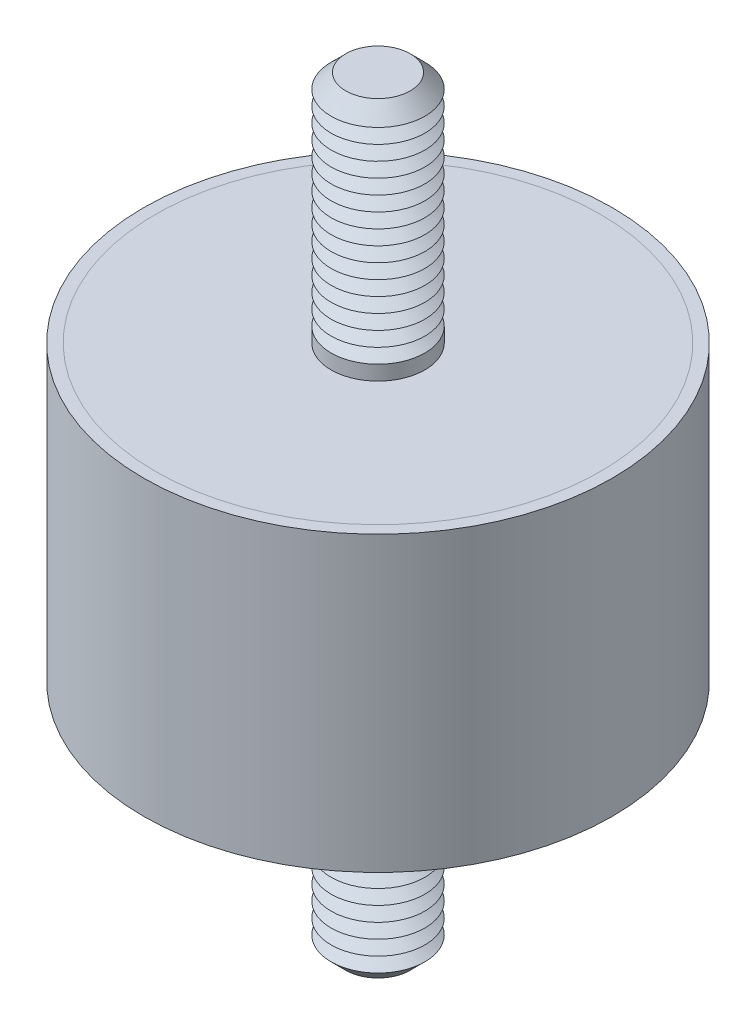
ISO-10303-21;
HEADER;
FILE_DESCRIPTION(('STEP AP214'),'2;1');
FILE_NAME('part.step','',(''),(''),'','','');
FILE_SCHEMA(('AUTOMOTIVE_DESIGN { 1 0 10303 214 1 1 1 1 }'));
ENDSEC;
DATA;
#1=APPLICATION_CONTEXT('core data for automotive mechanical design processes');
#2=APPLICATION_PROTOCOL_DEFINITION('international standard','automotive_design',2000,#1);
#3=PRODUCT_CONTEXT('',#1,'mechanical');
#4=PRODUCT('Part','Part','',(#3));
#5=PRODUCT_RELATED_PRODUCT_CATEGORY('part','',(#4));
#6=PRODUCT_DEFINITION_FORMATION('','',#4);
#7=PRODUCT_DEFINITION_CONTEXT('part definition',#1,'design');
#8=PRODUCT_DEFINITION('design','',#6,#7);
#9=PRODUCT_DEFINITION_SHAPE('','',#8);
#10=(LENGTH_UNIT() NAMED_UNIT(*) SI_UNIT(.MILLI.,.METRE.));
#11=(NAMED_UNIT(*) PLANE_ANGLE_UNIT() SI_UNIT($,.RADIAN.));
#12=(NAMED_UNIT(*) SI_UNIT($,.STERADIAN.) SOLID_ANGLE_UNIT());
#13=UNCERTAINTY_MEASURE_WITH_UNIT(LENGTH_MEASURE(1.E-05),#10,'distance_accuracy_value','');
#14=(GEOMETRIC_REPRESENTATION_CONTEXT(3) GLOBAL_UNCERTAINTY_ASSIGNED_CONTEXT((#13)) GLOBAL_UNIT_ASSIGNED_CONTEXT((#10,
#11,#12)) REPRESENTATION_CONTEXT('',''));
#15=CARTESIAN_POINT('',(0.,0.,0.));
#16=DIRECTION('',(0.,0.,1.));
#17=DIRECTION('',(1.,0.,0.));
#18=AXIS2_PLACEMENT_3D('',#15,#16,#17);
#19=CARTESIAN_POINT('',(0.,-32.5,0.));
#20=DIRECTION('',(0.,1.,0.));
#21=DIRECTION('',(0.,0.,1.));
#22=AXIS2_PLACEMENT_3D('',#19,#20,#21);
#23=CYLINDRICAL_SURFACE('',#22,4.);
#24=CARTESIAN_POINT('',(0.,-12.5,0.));
#25=DIRECTION('',(0.,-1.,0.));
#26=DIRECTION('',(0.,0.,-1.));
#27=AXIS2_PLACEMENT_3D('',#24,#25,#26);
#28=CIRCLE('',#27,4.);
#29=CARTESIAN_POINT('',(0.,-12.5,-4.));
#30=VERTEX_POINT('',#29);
#31=EDGE_CURVE('P0_E21',#30,#30,#28,.T.);
#32=ORIENTED_EDGE('',*,*,#31,.T.);
#33=EDGE_LOOP('',(#32));
#34=FACE_BOUND('',#33,.T.);
#35=CARTESIAN_POINT('',(0.,-13.75,0.));
#36=DIRECTION('',(0.,1.,0.));
#37=DIRECTION('',(0.,0.,1.));
#38=AXIS2_PLACEMENT_3D('',#35,#36,#37);
#39=CIRCLE('',#38,4.);
#40=CARTESIAN_POINT('',(0.,-13.75,4.));
#41=VERTEX_POINT('',#40);
#42=EDGE_CURVE('P0_E33',#41,#41,#39,.T.);
#43=ORIENTED_EDGE('',*,*,#42,.T.);
#44=EDGE_LOOP('',(#43));
#45=FACE_BOUND('',#44,.T.);
#46=ADVANCED_FACE('P0_F14',(#34,#45),#23,.T.);
#47=CARTESIAN_POINT('',(0.,-12.5,0.));
#48=DIRECTION('',(0.,1.,0.));
#49=DIRECTION('',(0.,0.,1.));
#50=AXIS2_PLACEMENT_3D('',#47,#48,#49);
#51=CYLINDRICAL_SURFACE('',#50,19.);
#52=CARTESIAN_POINT('',(0.,-12.5,0.));
#53=DIRECTION('',(0.,1.,0.));
#54=DIRECTION('',(0.,0.,1.));
#55=AXIS2_PLACEMENT_3D('',#52,#53,#54);
#56=CIRCLE('',#55,19.);
#57=CARTESIAN_POINT('',(0.,-12.5,19.));
#58=VERTEX_POINT('',#57);
#59=EDGE_CURVE('P0_E25',#58,#58,#56,.T.);
#60=ORIENTED_EDGE('',*,*,#59,.T.);
#61=EDGE_LOOP('',(#60));
#62=FACE_BOUND('',#61,.T.);
#63=CARTESIAN_POINT('',(0.,-11.5,0.));
#64=DIRECTION('',(0.,1.,0.));
#65=DIRECTION('',(0.,0.,1.));
#66=AXIS2_PLACEMENT_3D('',#63,#64,#65);
#67=CIRCLE('',#66,19.);
#68=CARTESIAN_POINT('',(0.,-11.5,19.));
#69=VERTEX_POINT('',#68);
#70=EDGE_CURVE('P0_E30',#69,#69,#67,.T.);
#71=ORIENTED_EDGE('',*,*,#70,.F.);
#72=EDGE_LOOP('',(#71));
#73=FACE_BOUND('',#72,.T.);
#74=ADVANCED_FACE('P0_F145',(#62,#73),#51,.T.);
#75=CARTESIAN_POINT('',(0.,-12.5,0.));
#76=DIRECTION('',(0.,1.,0.));
#77=DIRECTION('',(0.,0.,1.));
#78=AXIS2_PLACEMENT_3D('',#75,#76,#77);
#79=PLANE('',#78);
#80=ORIENTED_EDGE('',*,*,#31,.F.);
#81=EDGE_LOOP('',(#80));
#82=FACE_BOUND('',#81,.T.);
#83=ORIENTED_EDGE('',*,*,#59,.F.);
#84=EDGE_LOOP('',(#83));
#85=FACE_BOUND('',#84,.T.);
#86=ADVANCED_FACE('P0_F150',(#82,#85),#79,.F.);
#87=CARTESIAN_POINT('',(0.,-11.5,0.));
#88=DIRECTION('',(0.,1.,0.));
#89=DIRECTION('',(0.,0.,1.));
#90=AXIS2_PLACEMENT_3D('',#87,#88,#89);
#91=PLANE('',#90);
#92=ORIENTED_EDGE('',*,*,#70,.T.);
#93=EDGE_LOOP('',(#92));
#94=FACE_BOUND('',#93,.T.);
#95=ADVANCED_FACE('P0_F156',(#94),#91,.T.);
#96=CARTESIAN_POINT('',(0.,-13.75,0.));
#97=DIRECTION('',(0.,1.,0.));
#98=DIRECTION('',(0.,0.,1.));
#99=AXIS2_PLACEMENT_3D('',#96,#97,#98);
#100=CONICAL_SURFACE('',#99,4.,1.0471975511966);
#101=CARTESIAN_POINT('',(0.,-14.375,0.));
#102=DIRECTION('',(0.,1.,0.));
#103=DIRECTION('',(0.,0.,1.));
#104=AXIS2_PLACEMENT_3D('',#101,#102,#103);
#105=CIRCLE('',#104,2.91746824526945);
#106=CARTESIAN_POINT('',(0.,-14.375,2.91746824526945));
#107=VERTEX_POINT('',#106);
#108=EDGE_CURVE('P0_E39',#107,#107,#105,.T.);
#109=ORIENTED_EDGE('',*,*,#108,.T.);
#110=EDGE_LOOP('',(#109));
#111=FACE_BOUND('',#110,.T.);
#112=ORIENTED_EDGE('',*,*,#42,.F.);
#113=EDGE_LOOP('',(#112));
#114=FACE_BOUND('',#113,.T.);
#115=ADVANCED_FACE('P0_F159',(#111,#114),#100,.T.);
#116=CARTESIAN_POINT('',(0.,-14.375,0.));
#117=DIRECTION('',(0.,-1.,0.));
#118=DIRECTION('',(0.,0.,-1.));
#119=AXIS2_PLACEMENT_3D('',#116,#117,#118);
#120=CONICAL_SURFACE('',#119,2.91746824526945,1.0471975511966);
#121=CARTESIAN_POINT('',(0.,-15.,0.));
#122=DIRECTION('',(0.,1.,0.));
#123=DIRECTION('',(0.,0.,1.));
#124=AXIS2_PLACEMENT_3D('',#121,#122,#123);
#125=CIRCLE('',#124,4.);
#126=CARTESIAN_POINT('',(0.,-15.,4.));
#127=VERTEX_POINT('',#126);
#128=EDGE_CURVE('P0_E43',#127,#127,#125,.T.);
#129=ORIENTED_EDGE('',*,*,#128,.T.);
#130=EDGE_LOOP('',(#129));
#131=FACE_BOUND('',#130,.T.);
#132=ORIENTED_EDGE('',*,*,#108,.F.);
#133=EDGE_LOOP('',(#132));
#134=FACE_BOUND('',#133,.T.);
#135=ADVANCED_FACE('P0_F163',(#131,#134),#120,.T.);
#136=CARTESIAN_POINT('',(0.,-15.,0.));
#137=DIRECTION('',(0.,1.,0.));
#138=DIRECTION('',(0.,0.,1.));
#139=AXIS2_PLACEMENT_3D('',#136,#137,#138);
#140=CONICAL_SURFACE('',#139,4.,1.0471975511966);
#141=CARTESIAN_POINT('',(0.,-15.625,0.));
#142=DIRECTION('',(0.,1.,0.));
#143=DIRECTION('',(0.,0.,1.));
#144=AXIS2_PLACEMENT_3D('',#141,#142,#143);
#145=CIRCLE('',#144,2.91746824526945);
#146=CARTESIAN_POINT('',(0.,-15.625,2.91746824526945));
#147=VERTEX_POINT('',#146);
#148=EDGE_CURVE('P0_E47',#147,#147,#145,.T.);
#149=ORIENTED_EDGE('',*,*,#148,.T.);
#150=EDGE_LOOP('',(#149));
#151=FACE_BOUND('',#150,.T.);
#152=ORIENTED_EDGE('',*,*,#128,.F.);
#153=EDGE_LOOP('',(#152));
#154=FACE_BOUND('',#153,.T.);
#155=ADVANCED_FACE('P0_F167',(#151,#154),#140,.T.);
#156=CARTESIAN_POINT('',(0.,-15.625,0.));
#157=DIRECTION('',(0.,-1.,0.));
#158=DIRECTION('',(0.,0.,-1.));
#159=AXIS2_PLACEMENT_3D('',#156,#157,#158);
#160=CONICAL_SURFACE('',#159,2.91746824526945,1.0471975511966);
#161=CARTESIAN_POINT('',(0.,-16.25,0.));
#162=DIRECTION('',(0.,1.,0.));
#163=DIRECTION('',(0.,0.,1.));
#164=AXIS2_PLACEMENT_3D('',#161,#162,#163);
#165=CIRCLE('',#164,4.);
#166=CARTESIAN_POINT('',(0.,-16.25,4.));
#167=VERTEX_POINT('',#166);
#168=EDGE_CURVE('P0_E52',#167,#167,#165,.T.);
#169=ORIENTED_EDGE('',*,*,#168,.T.);
#170=EDGE_LOOP('',(#169));
#171=FACE_BOUND('',#170,.T.);
#172=ORIENTED_EDGE('',*,*,#148,.F.);
#173=EDGE_LOOP('',(#172));
#174=FACE_BOUND('',#173,.T.);
#175=ADVANCED_FACE('P0_F174',(#171,#174),#160,.T.);
#176=CARTESIAN_POINT('',(0.,-16.25,0.));
#177=DIRECTION('',(0.,1.,0.));
#178=DIRECTION('',(0.,0.,1.));
#179=AXIS2_PLACEMENT_3D('',#176,#177,#178);
#180=CONICAL_SURFACE('',#179,4.,1.0471975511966);
#181=CARTESIAN_POINT('',(0.,-16.875,0.));
#182=DIRECTION('',(0.,1.,0.));
#183=DIRECTION('',(0.,0.,1.));
#184=AXIS2_PLACEMENT_3D('',#181,#182,#183);
#185=CIRCLE('',#184,2.91746824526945);
#186=CARTESIAN_POINT('',(0.,-16.875,2.91746824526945));
#187=VERTEX_POINT('',#186);
#188=EDGE_CURVE('P0_E55',#187,#187,#185,.T.);
#189=ORIENTED_EDGE('',*,*,#188,.T.);
#190=EDGE_LOOP('',(#189));
#191=FACE_BOUND('',#190,.T.);
#192=ORIENTED_EDGE('',*,*,#168,.F.);
#193=EDGE_LOOP('',(#192));
#194=FACE_BOUND('',#193,.T.);
#195=ADVANCED_FACE('P0_F178',(#191,#194),#180,.T.);
#196=CARTESIAN_POINT('',(0.,-16.875,0.));
#197=DIRECTION('',(0.,-1.,0.));
#198=DIRECTION('',(0.,0.,-1.));
#199=AXIS2_PLACEMENT_3D('',#196,#197,#198);
#200=CONICAL_SURFACE('',#199,2.91746824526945,1.0471975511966);
#201=CARTESIAN_POINT('',(0.,-17.5,0.));
#202=DIRECTION('',(0.,1.,0.));
#203=DIRECTION('',(0.,0.,1.));
#204=AXIS2_PLACEMENT_3D('',#201,#202,#203);
#205=CIRCLE('',#204,4.);
#206=CARTESIAN_POINT('',(0.,-17.5,4.));
#207=VERTEX_POINT('',#206);
#208=EDGE_CURVE('P0_E58',#207,#207,#205,.T.);
#209=ORIENTED_EDGE('',*,*,#208,.T.);
#210=EDGE_LOOP('',(#209));
#211=FACE_BOUND('',#210,.T.);
#212=ORIENTED_EDGE('',*,*,#188,.F.);
#213=EDGE_LOOP('',(#212));
#214=FACE_BOUND('',#213,.T.);
#215=ADVANCED_FACE('P0_F182',(#211,#214),#200,.T.);
#216=CARTESIAN_POINT('',(0.,-17.5,0.));
#217=DIRECTION('',(0.,1.,0.));
#218=DIRECTION('',(0.,0.,1.));
#219=AXIS2_PLACEMENT_3D('',#216,#217,#218);
#220=CONICAL_SURFACE('',#219,4.,1.0471975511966);
#221=CARTESIAN_POINT('',(0.,-18.125,0.));
#222=DIRECTION('',(0.,1.,0.));
#223=DIRECTION('',(0.,0.,1.));
#224=AXIS2_PLACEMENT_3D('',#221,#222,#223);
#225=CIRCLE('',#224,2.91746824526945);
#226=CARTESIAN_POINT('',(0.,-18.125,2.91746824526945));
#227=VERTEX_POINT('',#226);
#228=EDGE_CURVE('P0_E61',#227,#227,#225,.T.);
#229=ORIENTED_EDGE('',*,*,#228,.T.);
#230=EDGE_LOOP('',(#229));
#231=FACE_BOUND('',#230,.T.);
#232=ORIENTED_EDGE('',*,*,#208,.F.);
#233=EDGE_LOOP('',(#232));
#234=FACE_BOUND('',#233,.T.);
#235=ADVANCED_FACE('P0_F186',(#231,#234),#220,.T.);
#236=CARTESIAN_POINT('',(0.,-18.125,0.));
#237=DIRECTION('',(0.,-1.,0.));
#238=DIRECTION('',(0.,0.,-1.));
#239=AXIS2_PLACEMENT_3D('',#236,#237,#238);
#240=CONICAL_SURFACE('',#239,2.91746824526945,1.0471975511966);
#241=CARTESIAN_POINT('',(0.,-18.75,0.));
#242=DIRECTION('',(0.,1.,0.));
#243=DIRECTION('',(0.,0.,1.));
#244=AXIS2_PLACEMENT_3D('',#241,#242,#243);
#245=CIRCLE('',#244,4.);
#246=CARTESIAN_POINT('',(0.,-18.75,4.));
#247=VERTEX_POINT('',#246);
#248=EDGE_CURVE('P0_E64',#247,#247,#245,.T.);
#249=ORIENTED_EDGE('',*,*,#248,.T.);
#250=EDGE_LOOP('',(#249));
#251=FACE_BOUND('',#250,.T.);
#252=ORIENTED_EDGE('',*,*,#228,.F.);
#253=EDGE_LOOP('',(#252));
#254=FACE_BOUND('',#253,.T.);
#255=ADVANCED_FACE('P0_F190',(#251,#254),#240,.T.);
#256=CARTESIAN_POINT('',(0.,-18.75,0.));
#257=DIRECTION('',(0.,1.,0.));
#258=DIRECTION('',(0.,0.,1.));
#259=AXIS2_PLACEMENT_3D('',#256,#257,#258);
#260=CONICAL_SURFACE('',#259,4.,1.0471975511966);
#261=CARTESIAN_POINT('',(0.,-19.375,0.));
#262=DIRECTION('',(0.,1.,0.));
#263=DIRECTION('',(0.,0.,1.));
#264=AXIS2_PLACEMENT_3D('',#261,#262,#263);
#265=CIRCLE('',#264,2.91746824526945);
#266=CARTESIAN_POINT('',(0.,-19.375,2.91746824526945));
#267=VERTEX_POINT('',#266);
#268=EDGE_CURVE('P0_E67',#267,#267,#265,.T.);
#269=ORIENTED_EDGE('',*,*,#268,.T.);
#270=EDGE_LOOP('',(#269));
#271=FACE_BOUND('',#270,.T.);
#272=ORIENTED_EDGE('',*,*,#248,.F.);
#273=EDGE_LOOP('',(#272));
#274=FACE_BOUND('',#273,.T.);
#275=ADVANCED_FACE('P0_F194',(#271,#274),#260,.T.);
#276=CARTESIAN_POINT('',(0.,-19.375,0.));
#277=DIRECTION('',(0.,-1.,0.));
#278=DIRECTION('',(0.,0.,-1.));
#279=AXIS2_PLACEMENT_3D('',#276,#277,#278);
#280=CONICAL_SURFACE('',#279,2.91746824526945,1.0471975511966);
#281=CARTESIAN_POINT('',(0.,-20.,0.));
#282=DIRECTION('',(0.,1.,0.));
#283=DIRECTION('',(0.,0.,1.));
#284=AXIS2_PLACEMENT_3D('',#281,#282,#283);
#285=CIRCLE('',#284,4.);
#286=CARTESIAN_POINT('',(0.,-20.,4.));
#287=VERTEX_POINT('',#286);
#288=EDGE_CURVE('P0_E70',#287,#287,#285,.T.);
#289=ORIENTED_EDGE('',*,*,#288,.T.);
#290=EDGE_LOOP('',(#289));
#291=FACE_BOUND('',#290,.T.);
#292=ORIENTED_EDGE('',*,*,#268,.F.);
#293=EDGE_LOOP('',(#292));
#294=FACE_BOUND('',#293,.T.);
#295=ADVANCED_FACE('P0_F198',(#291,#294),#280,.T.);
#296=CARTESIAN_POINT('',(0.,-20.,0.));
#297=DIRECTION('',(0.,1.,0.));
#298=DIRECTION('',(0.,0.,1.));
#299=AXIS2_PLACEMENT_3D('',#296,#297,#298);
#300=CONICAL_SURFACE('',#299,4.,1.0471975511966);
#301=CARTESIAN_POINT('',(0.,-20.625,0.));
#302=DIRECTION('',(0.,1.,0.));
#303=DIRECTION('',(0.,0.,1.));
#304=AXIS2_PLACEMENT_3D('',#301,#302,#303);
#305=CIRCLE('',#304,2.91746824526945);
#306=CARTESIAN_POINT('',(0.,-20.625,2.91746824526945));
#307=VERTEX_POINT('',#306);
#308=EDGE_CURVE('P0_E73',#307,#307,#305,.T.);
#309=ORIENTED_EDGE('',*,*,#308,.T.);
#310=EDGE_LOOP('',(#309));
#311=FACE_BOUND('',#310,.T.);
#312=ORIENTED_EDGE('',*,*,#288,.F.);
#313=EDGE_LOOP('',(#312));
#314=FACE_BOUND('',#313,.T.);
#315=ADVANCED_FACE('P0_F202',(#311,#314),#300,.T.);
#316=CARTESIAN_POINT('',(0.,-20.625,0.));
#317=DIRECTION('',(0.,-1.,0.));
#318=DIRECTION('',(0.,0.,-1.));
#319=AXIS2_PLACEMENT_3D('',#316,#317,#318);
#320=CONICAL_SURFACE('',#319,2.91746824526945,1.0471975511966);
#321=CARTESIAN_POINT('',(0.,-21.25,0.));
#322=DIRECTION('',(0.,1.,0.));
#323=DIRECTION('',(0.,0.,1.));
#324=AXIS2_PLACEMENT_3D('',#321,#322,#323);
#325=CIRCLE('',#324,4.);
#326=CARTESIAN_POINT('',(0.,-21.25,4.));
#327=VERTEX_POINT('',#326);
#328=EDGE_CURVE('P0_E76',#327,#327,#325,.T.);
#329=ORIENTED_EDGE('',*,*,#328,.T.);
#330=EDGE_LOOP('',(#329));
#331=FACE_BOUND('',#330,.T.);
#332=ORIENTED_EDGE('',*,*,#308,.F.);
#333=EDGE_LOOP('',(#332));
#334=FACE_BOUND('',#333,.T.);
#335=ADVANCED_FACE('P0_F206',(#331,#334),#320,.T.);
#336=CARTESIAN_POINT('',(0.,-21.25,0.));
#337=DIRECTION('',(0.,1.,0.));
#338=DIRECTION('',(0.,0.,1.));
#339=AXIS2_PLACEMENT_3D('',#336,#337,#338);
#340=CONICAL_SURFACE('',#339,4.,1.0471975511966);
#341=CARTESIAN_POINT('',(0.,-21.875,0.));
#342=DIRECTION('',(0.,1.,0.));
#343=DIRECTION('',(0.,0.,1.));
#344=AXIS2_PLACEMENT_3D('',#341,#342,#343);
#345=CIRCLE('',#344,2.91746824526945);
#346=CARTESIAN_POINT('',(0.,-21.875,2.91746824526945));
#347=VERTEX_POINT('',#346);
#348=EDGE_CURVE('P0_E79',#347,#347,#345,.T.);
#349=ORIENTED_EDGE('',*,*,#348,.T.);
#350=EDGE_LOOP('',(#349));
#351=FACE_BOUND('',#350,.T.);
#352=ORIENTED_EDGE('',*,*,#328,.F.);
#353=EDGE_LOOP('',(#352));
#354=FACE_BOUND('',#353,.T.);
#355=ADVANCED_FACE('P0_F210',(#351,#354),#340,.T.);
#356=CARTESIAN_POINT('',(0.,-21.875,0.));
#357=DIRECTION('',(0.,-1.,0.));
#358=DIRECTION('',(0.,0.,-1.));
#359=AXIS2_PLACEMENT_3D('',#356,#357,#358);
#360=CONICAL_SURFACE('',#359,2.91746824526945,1.0471975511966);
#361=CARTESIAN_POINT('',(0.,-22.5,0.));
#362=DIRECTION('',(0.,1.,0.));
#363=DIRECTION('',(0.,0.,1.));
#364=AXIS2_PLACEMENT_3D('',#361,#362,#363);
#365=CIRCLE('',#364,4.);
#366=CARTESIAN_POINT('',(0.,-22.5,4.));
#367=VERTEX_POINT('',#366);
#368=EDGE_CURVE('P0_E82',#367,#367,#365,.T.);
#369=ORIENTED_EDGE('',*,*,#368,.T.);
#370=EDGE_LOOP('',(#369));
#371=FACE_BOUND('',#370,.T.);
#372=ORIENTED_EDGE('',*,*,#348,.F.);
#373=EDGE_LOOP('',(#372));
#374=FACE_BOUND('',#373,.T.);
#375=ADVANCED_FACE('P0_F214',(#371,#374),#360,.T.);
#376=CARTESIAN_POINT('',(0.,-22.5,0.));
#377=DIRECTION('',(0.,1.,0.));
#378=DIRECTION('',(0.,0.,1.));
#379=AXIS2_PLACEMENT_3D('',#376,#377,#378);
#380=CONICAL_SURFACE('',#379,4.,1.0471975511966);
#381=CARTESIAN_POINT('',(0.,-23.125,0.));
#382=DIRECTION('',(0.,1.,0.));
#383=DIRECTION('',(0.,0.,1.));
#384=AXIS2_PLACEMENT_3D('',#381,#382,#383);
#385=CIRCLE('',#384,2.91746824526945);
#386=CARTESIAN_POINT('',(0.,-23.125,2.91746824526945));
#387=VERTEX_POINT('',#386);
#388=EDGE_CURVE('P0_E85',#387,#387,#385,.T.);
#389=ORIENTED_EDGE('',*,*,#388,.T.);
#390=EDGE_LOOP('',(#389));
#391=FACE_BOUND('',#390,.T.);
#392=ORIENTED_EDGE('',*,*,#368,.F.);
#393=EDGE_LOOP('',(#392));
#394=FACE_BOUND('',#393,.T.);
#395=ADVANCED_FACE('P0_F218',(#391,#394),#380,.T.);
#396=CARTESIAN_POINT('',(0.,-23.125,0.));
#397=DIRECTION('',(0.,-1.,0.));
#398=DIRECTION('',(0.,0.,-1.));
#399=AXIS2_PLACEMENT_3D('',#396,#397,#398);
#400=CONICAL_SURFACE('',#399,2.91746824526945,1.0471975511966);
#401=CARTESIAN_POINT('',(0.,-23.75,0.));
#402=DIRECTION('',(0.,1.,0.));
#403=DIRECTION('',(0.,0.,1.));
#404=AXIS2_PLACEMENT_3D('',#401,#402,#403);
#405=CIRCLE('',#404,4.);
#406=CARTESIAN_POINT('',(0.,-23.75,4.));
#407=VERTEX_POINT('',#406);
#408=EDGE_CURVE('P0_E88',#407,#407,#405,.T.);
#409=ORIENTED_EDGE('',*,*,#408,.T.);
#410=EDGE_LOOP('',(#409));
#411=FACE_BOUND('',#410,.T.);
#412=ORIENTED_EDGE('',*,*,#388,.F.);
#413=EDGE_LOOP('',(#412));
#414=FACE_BOUND('',#413,.T.);
#415=ADVANCED_FACE('P0_F222',(#411,#414),#400,.T.);
#416=CARTESIAN_POINT('',(0.,-23.75,0.));
#417=DIRECTION('',(0.,1.,0.));
#418=DIRECTION('',(0.,0.,1.));
#419=AXIS2_PLACEMENT_3D('',#416,#417,#418);
#420=CONICAL_SURFACE('',#419,4.,1.0471975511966);
#421=CARTESIAN_POINT('',(0.,-24.375,0.));
#422=DIRECTION('',(0.,1.,0.));
#423=DIRECTION('',(0.,0.,1.));
#424=AXIS2_PLACEMENT_3D('',#421,#422,#423);
#425=CIRCLE('',#424,2.91746824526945);
#426=CARTESIAN_POINT('',(0.,-24.375,2.91746824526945));
#427=VERTEX_POINT('',#426);
#428=EDGE_CURVE('P0_E91',#427,#427,#425,.T.);
#429=ORIENTED_EDGE('',*,*,#428,.T.);
#430=EDGE_LOOP('',(#429));
#431=FACE_BOUND('',#430,.T.);
#432=ORIENTED_EDGE('',*,*,#408,.F.);
#433=EDGE_LOOP('',(#432));
#434=FACE_BOUND('',#433,.T.);
#435=ADVANCED_FACE('P0_F226',(#431,#434),#420,.T.);
#436=CARTESIAN_POINT('',(0.,-24.375,0.));
#437=DIRECTION('',(0.,-1.,0.));
#438=DIRECTION('',(0.,0.,-1.));
#439=AXIS2_PLACEMENT_3D('',#436,#437,#438);
#440=CONICAL_SURFACE('',#439,2.91746824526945,1.0471975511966);
#441=CARTESIAN_POINT('',(0.,-25.,0.));
#442=DIRECTION('',(0.,1.,0.));
#443=DIRECTION('',(0.,0.,1.));
#444=AXIS2_PLACEMENT_3D('',#441,#442,#443);
#445=CIRCLE('',#444,4.);
#446=CARTESIAN_POINT('',(0.,-25.,4.));
#447=VERTEX_POINT('',#446);
#448=EDGE_CURVE('P0_E94',#447,#447,#445,.T.);
#449=ORIENTED_EDGE('',*,*,#448,.T.);
#450=EDGE_LOOP('',(#449));
#451=FACE_BOUND('',#450,.T.);
#452=ORIENTED_EDGE('',*,*,#428,.F.);
#453=EDGE_LOOP('',(#452));
#454=FACE_BOUND('',#453,.T.);
#455=ADVANCED_FACE('P0_F230',(#451,#454),#440,.T.);
#456=CARTESIAN_POINT('',(0.,-25.,0.));
#457=DIRECTION('',(0.,1.,0.));
#458=DIRECTION('',(0.,0.,1.));
#459=AXIS2_PLACEMENT_3D('',#456,#457,#458);
#460=CONICAL_SURFACE('',#459,4.,1.0471975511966);
#461=CARTESIAN_POINT('',(0.,-25.625,0.));
#462=DIRECTION('',(0.,1.,0.));
#463=DIRECTION('',(0.,0.,1.));
#464=AXIS2_PLACEMENT_3D('',#461,#462,#463);
#465=CIRCLE('',#464,2.91746824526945);
#466=CARTESIAN_POINT('',(0.,-25.625,2.91746824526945));
#467=VERTEX_POINT('',#466);
#468=EDGE_CURVE('P0_E97',#467,#467,#465,.T.);
#469=ORIENTED_EDGE('',*,*,#468,.T.);
#470=EDGE_LOOP('',(#469));
#471=FACE_BOUND('',#470,.T.);
#472=ORIENTED_EDGE('',*,*,#448,.F.);
#473=EDGE_LOOP('',(#472));
#474=FACE_BOUND('',#473,.T.);
#475=ADVANCED_FACE('P0_F234',(#471,#474),#460,.T.);
#476=CARTESIAN_POINT('',(0.,-25.625,0.));
#477=DIRECTION('',(0.,-1.,0.));
#478=DIRECTION('',(0.,0.,-1.));
#479=AXIS2_PLACEMENT_3D('',#476,#477,#478);
#480=CONICAL_SURFACE('',#479,2.91746824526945,1.0471975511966);
#481=CARTESIAN_POINT('',(0.,-26.25,0.));
#482=DIRECTION('',(0.,1.,0.));
#483=DIRECTION('',(0.,0.,1.));
#484=AXIS2_PLACEMENT_3D('',#481,#482,#483);
#485=CIRCLE('',#484,4.);
#486=CARTESIAN_POINT('',(0.,-26.25,4.));
#487=VERTEX_POINT('',#486);
#488=EDGE_CURVE('P0_E100',#487,#487,#485,.T.);
#489=ORIENTED_EDGE('',*,*,#488,.T.);
#490=EDGE_LOOP('',(#489));
#491=FACE_BOUND('',#490,.T.);
#492=ORIENTED_EDGE('',*,*,#468,.F.);
#493=EDGE_LOOP('',(#492));
#494=FACE_BOUND('',#493,.T.);
#495=ADVANCED_FACE('P0_F238',(#491,#494),#480,.T.);
#496=CARTESIAN_POINT('',(0.,-26.25,0.));
#497=DIRECTION('',(0.,1.,0.));
#498=DIRECTION('',(0.,0.,1.));
#499=AXIS2_PLACEMENT_3D('',#496,#497,#498);
#500=CONICAL_SURFACE('',#499,4.,1.0471975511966);
#501=CARTESIAN_POINT('',(0.,-26.875,0.));
#502=DIRECTION('',(0.,1.,0.));
#503=DIRECTION('',(0.,0.,1.));
#504=AXIS2_PLACEMENT_3D('',#501,#502,#503);
#505=CIRCLE('',#504,2.91746824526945);
#506=CARTESIAN_POINT('',(0.,-26.875,2.91746824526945));
#507=VERTEX_POINT('',#506);
#508=EDGE_CURVE('P0_E103',#507,#507,#505,.T.);
#509=ORIENTED_EDGE('',*,*,#508,.T.);
#510=EDGE_LOOP('',(#509));
#511=FACE_BOUND('',#510,.T.);
#512=ORIENTED_EDGE('',*,*,#488,.F.);
#513=EDGE_LOOP('',(#512));
#514=FACE_BOUND('',#513,.T.);
#515=ADVANCED_FACE('P0_F242',(#511,#514),#500,.T.);
#516=CARTESIAN_POINT('',(0.,-26.875,0.));
#517=DIRECTION('',(0.,-1.,0.));
#518=DIRECTION('',(0.,0.,-1.));
#519=AXIS2_PLACEMENT_3D('',#516,#517,#518);
#520=CONICAL_SURFACE('',#519,2.91746824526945,1.0471975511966);
#521=CARTESIAN_POINT('',(0.,-27.5,0.));
#522=DIRECTION('',(0.,1.,0.));
#523=DIRECTION('',(0.,0.,1.));
#524=AXIS2_PLACEMENT_3D('',#521,#522,#523);
#525=CIRCLE('',#524,4.);
#526=CARTESIAN_POINT('',(0.,-27.5,4.));
#527=VERTEX_POINT('',#526);
#528=EDGE_CURVE('P0_E106',#527,#527,#525,.T.);
#529=ORIENTED_EDGE('',*,*,#528,.T.);
#530=EDGE_LOOP('',(#529));
#531=FACE_BOUND('',#530,.T.);
#532=ORIENTED_EDGE('',*,*,#508,.F.);
#533=EDGE_LOOP('',(#532));
#534=FACE_BOUND('',#533,.T.);
#535=ADVANCED_FACE('P0_F246',(#531,#534),#520,.T.);
#536=CARTESIAN_POINT('',(0.,-27.5,0.));
#537=DIRECTION('',(0.,1.,0.));
#538=DIRECTION('',(0.,0.,1.));
#539=AXIS2_PLACEMENT_3D('',#536,#537,#538);
#540=CONICAL_SURFACE('',#539,4.,1.0471975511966);
#541=CARTESIAN_POINT('',(0.,-28.125,0.));
#542=DIRECTION('',(0.,1.,0.));
#543=DIRECTION('',(0.,0.,1.));
#544=AXIS2_PLACEMENT_3D('',#541,#542,#543);
#545=CIRCLE('',#544,2.91746824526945);
#546=CARTESIAN_POINT('',(0.,-28.125,2.91746824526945));
#547=VERTEX_POINT('',#546);
#548=EDGE_CURVE('P0_E109',#547,#547,#545,.T.);
#549=ORIENTED_EDGE('',*,*,#548,.T.);
#550=EDGE_LOOP('',(#549));
#551=FACE_BOUND('',#550,.T.);
#552=ORIENTED_EDGE('',*,*,#528,.F.);
#553=EDGE_LOOP('',(#552));
#554=FACE_BOUND('',#553,.T.);
#555=ADVANCED_FACE('P0_F250',(#551,#554),#540,.T.);
#556=CARTESIAN_POINT('',(0.,-28.125,0.));
#557=DIRECTION('',(0.,-1.,0.));
#558=DIRECTION('',(0.,0.,-1.));
#559=AXIS2_PLACEMENT_3D('',#556,#557,#558);
#560=CONICAL_SURFACE('',#559,2.91746824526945,1.0471975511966);
#561=CARTESIAN_POINT('',(0.,-28.75,0.));
#562=DIRECTION('',(0.,1.,0.));
#563=DIRECTION('',(0.,0.,1.));
#564=AXIS2_PLACEMENT_3D('',#561,#562,#563);
#565=CIRCLE('',#564,4.);
#566=CARTESIAN_POINT('',(0.,-28.75,4.));
#567=VERTEX_POINT('',#566);
#568=EDGE_CURVE('P0_E112',#567,#567,#565,.T.);
#569=ORIENTED_EDGE('',*,*,#568,.T.);
#570=EDGE_LOOP('',(#569));
#571=FACE_BOUND('',#570,.T.);
#572=ORIENTED_EDGE('',*,*,#548,.F.);
#573=EDGE_LOOP('',(#572));
#574=FACE_BOUND('',#573,.T.);
#575=ADVANCED_FACE('P0_F254',(#571,#574),#560,.T.);
#576=CARTESIAN_POINT('',(0.,-28.75,0.));
#577=DIRECTION('',(0.,1.,0.));
#578=DIRECTION('',(0.,0.,1.));
#579=AXIS2_PLACEMENT_3D('',#576,#577,#578);
#580=CONICAL_SURFACE('',#579,4.,1.0471975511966);
#581=CARTESIAN_POINT('',(0.,-29.375,0.));
#582=DIRECTION('',(0.,1.,0.));
#583=DIRECTION('',(0.,0.,1.));
#584=AXIS2_PLACEMENT_3D('',#581,#582,#583);
#585=CIRCLE('',#584,2.91746824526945);
#586=CARTESIAN_POINT('',(0.,-29.375,2.91746824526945));
#587=VERTEX_POINT('',#586);
#588=EDGE_CURVE('P0_E115',#587,#587,#585,.T.);
#589=ORIENTED_EDGE('',*,*,#588,.T.);
#590=EDGE_LOOP('',(#589));
#591=FACE_BOUND('',#590,.T.);
#592=ORIENTED_EDGE('',*,*,#568,.F.);
#593=EDGE_LOOP('',(#592));
#594=FACE_BOUND('',#593,.T.);
#595=ADVANCED_FACE('P0_F258',(#591,#594),#580,.T.);
#596=CARTESIAN_POINT('',(0.,-29.375,0.));
#597=DIRECTION('',(0.,-1.,0.));
#598=DIRECTION('',(0.,0.,-1.));
#599=AXIS2_PLACEMENT_3D('',#596,#597,#598);
#600=CONICAL_SURFACE('',#599,2.91746824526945,1.0471975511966);
#601=CARTESIAN_POINT('',(0.,-30.,0.));
#602=DIRECTION('',(0.,1.,0.));
#603=DIRECTION('',(0.,0.,1.));
#604=AXIS2_PLACEMENT_3D('',#601,#602,#603);
#605=CIRCLE('',#604,4.);
#606=CARTESIAN_POINT('',(0.,-30.,4.));
#607=VERTEX_POINT('',#606);
#608=EDGE_CURVE('P0_E118',#607,#607,#605,.T.);
#609=ORIENTED_EDGE('',*,*,#608,.T.);
#610=EDGE_LOOP('',(#609));
#611=FACE_BOUND('',#610,.T.);
#612=ORIENTED_EDGE('',*,*,#588,.F.);
#613=EDGE_LOOP('',(#612));
#614=FACE_BOUND('',#613,.T.);
#615=ADVANCED_FACE('P0_F142',(#611,#614),#600,.T.);
#616=CARTESIAN_POINT('',(0.,-30.,0.));
#617=DIRECTION('',(0.,1.,0.));
#618=DIRECTION('',(0.,0.,1.));
#619=AXIS2_PLACEMENT_3D('',#616,#617,#618);
#620=CONICAL_SURFACE('',#619,4.,1.0471975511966);
#621=CARTESIAN_POINT('',(0.,-30.625,0.));
#622=DIRECTION('',(0.,1.,0.));
#623=DIRECTION('',(0.,0.,1.));
#624=AXIS2_PLACEMENT_3D('',#621,#622,#623);
#625=CIRCLE('',#624,2.91746824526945);
#626=CARTESIAN_POINT('',(0.,-30.625,2.91746824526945));
#627=VERTEX_POINT('',#626);
#628=EDGE_CURVE('P0_E124',#627,#627,#625,.T.);
#629=ORIENTED_EDGE('',*,*,#628,.T.);
#630=EDGE_LOOP('',(#629));
#631=FACE_BOUND('',#630,.T.);
#632=ORIENTED_EDGE('',*,*,#608,.F.);
#633=EDGE_LOOP('',(#632));
#634=FACE_BOUND('',#633,.T.);
#635=ADVANCED_FACE('P0_F128',(#631,#634),#620,.T.);
#636=CARTESIAN_POINT('',(0.,-30.625,0.));
#637=DIRECTION('',(0.,-1.,0.));
#638=DIRECTION('',(0.,0.,-1.));
#639=AXIS2_PLACEMENT_3D('',#636,#637,#638);
#640=CONICAL_SURFACE('',#639,2.91746824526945,1.0471975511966);
#641=CARTESIAN_POINT('',(0.,-31.25,0.));
#642=DIRECTION('',(0.,1.,0.));
#643=DIRECTION('',(0.,0.,1.));
#644=AXIS2_PLACEMENT_3D('',#641,#642,#643);
#645=CIRCLE('',#644,4.);
#646=CARTESIAN_POINT('',(0.,-31.25,4.));
#647=VERTEX_POINT('',#646);
#648=EDGE_CURVE('P0_E121',#647,#647,#645,.T.);
#649=ORIENTED_EDGE('',*,*,#648,.T.);
#650=EDGE_LOOP('',(#649));
#651=FACE_BOUND('',#650,.T.);
#652=ORIENTED_EDGE('',*,*,#628,.F.);
#653=EDGE_LOOP('',(#652));
#654=FACE_BOUND('',#653,.T.);
#655=ADVANCED_FACE('P0_F131',(#651,#654),#640,.T.);
#656=CARTESIAN_POINT('',(0.,-32.5,0.));
#657=DIRECTION('',(0.,-1.,0.));
#658=DIRECTION('',(0.,0.,-1.));
#659=AXIS2_PLACEMENT_3D('',#656,#657,#658);
#660=PLANE('',#659);
#661=CARTESIAN_POINT('',(0.,-32.5,0.));
#662=DIRECTION('',(0.,-1.,0.));
#663=DIRECTION('',(0.,0.,-1.));
#664=AXIS2_PLACEMENT_3D('',#661,#662,#663);
#665=CIRCLE('',#664,2.75);
#666=CARTESIAN_POINT('',(0.,-32.5,-2.75));
#667=VERTEX_POINT('',#666);
#668=EDGE_CURVE('P0_E10',#667,#667,#665,.T.);
#669=ORIENTED_EDGE('',*,*,#668,.T.);
#670=EDGE_LOOP('',(#669));
#671=FACE_BOUND('',#670,.T.);
#672=ADVANCED_FACE('P0_F133',(#671),#660,.T.);
#673=CARTESIAN_POINT('',(0.,-32.5,0.));
#674=DIRECTION('',(0.,1.,0.));
#675=DIRECTION('',(0.,0.,1.));
#676=AXIS2_PLACEMENT_3D('',#673,#674,#675);
#677=CONICAL_SURFACE('',#676,2.75,0.785398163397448);
#678=ORIENTED_EDGE('',*,*,#648,.F.);
#679=EDGE_LOOP('',(#678));
#680=FACE_BOUND('',#679,.T.);
#681=ORIENTED_EDGE('',*,*,#668,.F.);
#682=EDGE_LOOP('',(#681));
#683=FACE_BOUND('',#682,.T.);
#684=ADVANCED_FACE('P0_F16',(#680,#683),#677,.T.);
#685=CLOSED_SHELL('',(#46,#74,#86,#95,#115,#135,#155,#175,#195,#215,#235,#255,#275,#295,#315,
#335,#355,#375,#395,#415,#435,#455,#475,#495,#515,#535,#555,#575,#595,#615,#635,#655,#672,#684));
#686=MANIFOLD_SOLID_BREP('P0_B1',#685);
#687=CARTESIAN_POINT('',(0.,32.5,0.));
#688=DIRECTION('',(0.,-1.,0.));
#689=DIRECTION('',(0.,0.,-1.));
#690=AXIS2_PLACEMENT_3D('',#687,#688,#689);
#691=CYLINDRICAL_SURFACE('',#690,4.);
#692=CARTESIAN_POINT('',(0.,13.75,0.));
#693=DIRECTION('',(0.,1.,0.));
#694=DIRECTION('',(0.,0.,1.));
#695=AXIS2_PLACEMENT_3D('',#692,#693,#694);
#696=CIRCLE('',#695,4.);
#697=CARTESIAN_POINT('',(0.,13.75,4.));
#698=VERTEX_POINT('',#697);
#699=EDGE_CURVE('P1_E33',#698,#698,#696,.T.);
#700=ORIENTED_EDGE('',*,*,#699,.F.);
#701=EDGE_LOOP('',(#700));
#702=FACE_BOUND('',#701,.T.);
#703=CARTESIAN_POINT('',(0.,12.5,0.));
#704=DIRECTION('',(0.,1.,0.));
#705=DIRECTION('',(0.,0.,1.));
#706=AXIS2_PLACEMENT_3D('',#703,#704,#705);
#707=CIRCLE('',#706,4.);
#708=CARTESIAN_POINT('',(0.,12.5,4.));
#709=VERTEX_POINT('',#708);
#710=EDGE_CURVE('P1_E21',#709,#709,#707,.T.);
#711=ORIENTED_EDGE('',*,*,#710,.T.);
#712=EDGE_LOOP('',(#711));
#713=FACE_BOUND('',#712,.T.);
#714=ADVANCED_FACE('P1_F14',(#702,#713),#691,.T.);
#715=CARTESIAN_POINT('',(0.,12.5,0.));
#716=DIRECTION('',(0.,-1.,0.));
#717=DIRECTION('',(0.,0.,-1.));
#718=AXIS2_PLACEMENT_3D('',#715,#716,#717);
#719=CYLINDRICAL_SURFACE('',#718,19.);
#720=CARTESIAN_POINT('',(0.,12.5,0.));
#721=DIRECTION('',(0.,1.,0.));
#722=DIRECTION('',(0.,0.,1.));
#723=AXIS2_PLACEMENT_3D('',#720,#721,#722);
#724=CIRCLE('',#723,19.);
#725=CARTESIAN_POINT('',(0.,12.5,19.));
#726=VERTEX_POINT('',#725);
#727=EDGE_CURVE('P1_E25',#726,#726,#724,.T.);
#728=ORIENTED_EDGE('',*,*,#727,.F.);
#729=EDGE_LOOP('',(#728));
#730=FACE_BOUND('',#729,.T.);
#731=CARTESIAN_POINT('',(0.,11.5,0.));
#732=DIRECTION('',(0.,1.,0.));
#733=DIRECTION('',(0.,0.,1.));
#734=AXIS2_PLACEMENT_3D('',#731,#732,#733);
#735=CIRCLE('',#734,19.);
#736=CARTESIAN_POINT('',(0.,11.5,19.));
#737=VERTEX_POINT('',#736);
#738=EDGE_CURVE('P1_E30',#737,#737,#735,.T.);
#739=ORIENTED_EDGE('',*,*,#738,.T.);
#740=EDGE_LOOP('',(#739));
#741=FACE_BOUND('',#740,.T.);
#742=ADVANCED_FACE('P1_F292',(#730,#741),#719,.T.);
#743=CARTESIAN_POINT('',(0.,12.5,0.));
#744=DIRECTION('',(0.,1.,0.));
#745=DIRECTION('',(0.,0.,1.));
#746=AXIS2_PLACEMENT_3D('',#743,#744,#745);
#747=PLANE('',#746);
#748=ORIENTED_EDGE('',*,*,#710,.F.);
#749=EDGE_LOOP('',(#748));
#750=FACE_BOUND('',#749,.T.);
#751=ORIENTED_EDGE('',*,*,#727,.T.);
#752=EDGE_LOOP('',(#751));
#753=FACE_BOUND('',#752,.T.);
#754=ADVANCED_FACE('P1_F298',(#750,#753),#747,.T.);
#755=CARTESIAN_POINT('',(0.,11.5,0.));
#756=DIRECTION('',(0.,1.,0.));
#757=DIRECTION('',(0.,0.,1.));
#758=AXIS2_PLACEMENT_3D('',#755,#756,#757);
#759=PLANE('',#758);
#760=ORIENTED_EDGE('',*,*,#738,.F.);
#761=EDGE_LOOP('',(#760));
#762=FACE_BOUND('',#761,.T.);
#763=ADVANCED_FACE('P1_F288',(#762),#759,.F.);
#764=CARTESIAN_POINT('',(0.,13.75,0.));
#765=DIRECTION('',(0.,-1.,0.));
#766=DIRECTION('',(0.,0.,-1.));
#767=AXIS2_PLACEMENT_3D('',#764,#765,#766);
#768=CONICAL_SURFACE('',#767,4.,1.0471975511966);
#769=CARTESIAN_POINT('',(0.,14.375,0.));
#770=DIRECTION('',(0.,1.,0.));
#771=DIRECTION('',(0.,0.,1.));
#772=AXIS2_PLACEMENT_3D('',#769,#770,#771);
#773=CIRCLE('',#772,2.91746824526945);
#774=CARTESIAN_POINT('',(0.,14.375,2.91746824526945));
#775=VERTEX_POINT('',#774);
#776=EDGE_CURVE('P1_E39',#775,#775,#773,.T.);
#777=ORIENTED_EDGE('',*,*,#776,.F.);
#778=EDGE_LOOP('',(#777));
#779=FACE_BOUND('',#778,.T.);
#780=ORIENTED_EDGE('',*,*,#699,.T.);
#781=EDGE_LOOP('',(#780));
#782=FACE_BOUND('',#781,.T.);
#783=ADVANCED_FACE('P1_F282',(#779,#782),#768,.T.);
#784=CARTESIAN_POINT('',(0.,14.375,0.));
#785=DIRECTION('',(0.,1.,0.));
#786=DIRECTION('',(0.,0.,1.));
#787=AXIS2_PLACEMENT_3D('',#784,#785,#786);
#788=CONICAL_SURFACE('',#787,2.91746824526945,1.0471975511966);
#789=CARTESIAN_POINT('',(0.,15.,0.));
#790=DIRECTION('',(0.,1.,0.));
#791=DIRECTION('',(0.,0.,1.));
#792=AXIS2_PLACEMENT_3D('',#789,#790,#791);
#793=CIRCLE('',#792,4.);
#794=CARTESIAN_POINT('',(0.,15.,4.));
#795=VERTEX_POINT('',#794);
#796=EDGE_CURVE('P1_E43',#795,#795,#793,.T.);
#797=ORIENTED_EDGE('',*,*,#796,.F.);
#798=EDGE_LOOP('',(#797));
#799=FACE_BOUND('',#798,.T.);
#800=ORIENTED_EDGE('',*,*,#776,.T.);
#801=EDGE_LOOP('',(#800));
#802=FACE_BOUND('',#801,.T.);
#803=ADVANCED_FACE('P1_F277',(#799,#802),#788,.T.);
#804=CARTESIAN_POINT('',(0.,15.,0.));
#805=DIRECTION('',(0.,-1.,0.));
#806=DIRECTION('',(0.,0.,-1.));
#807=AXIS2_PLACEMENT_3D('',#804,#805,#806);
#808=CONICAL_SURFACE('',#807,4.,1.0471975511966);
#809=CARTESIAN_POINT('',(0.,15.625,0.));
#810=DIRECTION('',(0.,1.,0.));
#811=DIRECTION('',(0.,0.,1.));
#812=AXIS2_PLACEMENT_3D('',#809,#810,#811);
#813=CIRCLE('',#812,2.91746824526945);
#814=CARTESIAN_POINT('',(0.,15.625,2.91746824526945));
#815=VERTEX_POINT('',#814);
#816=EDGE_CURVE('P1_E47',#815,#815,#813,.T.);
#817=ORIENTED_EDGE('',*,*,#816,.F.);
#818=EDGE_LOOP('',(#817));
#819=FACE_BOUND('',#818,.T.);
#820=ORIENTED_EDGE('',*,*,#796,.T.);
#821=EDGE_LOOP('',(#820));
#822=FACE_BOUND('',#821,.T.);
#823=ADVANCED_FACE('P1_F271',(#819,#822),#808,.T.);
#824=CARTESIAN_POINT('',(0.,15.625,0.));
#825=DIRECTION('',(0.,1.,0.));
#826=DIRECTION('',(0.,0.,1.));
#827=AXIS2_PLACEMENT_3D('',#824,#825,#826);
#828=CONICAL_SURFACE('',#827,2.91746824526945,1.0471975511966);
#829=CARTESIAN_POINT('',(0.,16.25,0.));
#830=DIRECTION('',(0.,1.,0.));
#831=DIRECTION('',(0.,0.,1.));
#832=AXIS2_PLACEMENT_3D('',#829,#830,#831);
#833=CIRCLE('',#832,4.);
#834=CARTESIAN_POINT('',(0.,16.25,4.));
#835=VERTEX_POINT('',#834);
#836=EDGE_CURVE('P1_E52',#835,#835,#833,.T.);
#837=ORIENTED_EDGE('',*,*,#836,.F.);
#838=EDGE_LOOP('',(#837));
#839=FACE_BOUND('',#838,.T.);
#840=ORIENTED_EDGE('',*,*,#816,.T.);
#841=EDGE_LOOP('',(#840));
#842=FACE_BOUND('',#841,.T.);
#843=ADVANCED_FACE('P1_F265',(#839,#842),#828,.T.);
#844=CARTESIAN_POINT('',(0.,16.25,0.));
#845=DIRECTION('',(0.,-1.,0.));
#846=DIRECTION('',(0.,0.,-1.));
#847=AXIS2_PLACEMENT_3D('',#844,#845,#846);
#848=CONICAL_SURFACE('',#847,4.,1.0471975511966);
#849=CARTESIAN_POINT('',(0.,16.875,0.));
#850=DIRECTION('',(0.,1.,0.));
#851=DIRECTION('',(0.,0.,1.));
#852=AXIS2_PLACEMENT_3D('',#849,#850,#851);
#853=CIRCLE('',#852,2.91746824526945);
#854=CARTESIAN_POINT('',(0.,16.875,2.91746824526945));
#855=VERTEX_POINT('',#854);
#856=EDGE_CURVE('P1_E55',#855,#855,#853,.T.);
#857=ORIENTED_EDGE('',*,*,#856,.F.);
#858=EDGE_LOOP('',(#857));
#859=FACE_BOUND('',#858,.T.);
#860=ORIENTED_EDGE('',*,*,#836,.T.);
#861=EDGE_LOOP('',(#860));
#862=FACE_BOUND('',#861,.T.);
#863=ADVANCED_FACE('P1_F259',(#859,#862),#848,.T.);
#864=CARTESIAN_POINT('',(0.,16.875,0.));
#865=DIRECTION('',(0.,1.,0.));
#866=DIRECTION('',(0.,0.,1.));
#867=AXIS2_PLACEMENT_3D('',#864,#865,#866);
#868=CONICAL_SURFACE('',#867,2.91746824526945,1.0471975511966);
#869=CARTESIAN_POINT('',(0.,17.5,0.));
#870=DIRECTION('',(0.,1.,0.));
#871=DIRECTION('',(0.,0.,1.));
#872=AXIS2_PLACEMENT_3D('',#869,#870,#871);
#873=CIRCLE('',#872,4.);
#874=CARTESIAN_POINT('',(0.,17.5,4.));
#875=VERTEX_POINT('',#874);
#876=EDGE_CURVE('P1_E58',#875,#875,#873,.T.);
#877=ORIENTED_EDGE('',*,*,#876,.F.);
#878=EDGE_LOOP('',(#877));
#879=FACE_BOUND('',#878,.T.);
#880=ORIENTED_EDGE('',*,*,#856,.T.);
#881=EDGE_LOOP('',(#880));
#882=FACE_BOUND('',#881,.T.);
#883=ADVANCED_FACE('P1_F253',(#879,#882),#868,.T.);
#884=CARTESIAN_POINT('',(0.,17.5,0.));
#885=DIRECTION('',(0.,-1.,0.));
#886=DIRECTION('',(0.,0.,-1.));
#887=AXIS2_PLACEMENT_3D('',#884,#885,#886);
#888=CONICAL_SURFACE('',#887,4.,1.0471975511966);
#889=CARTESIAN_POINT('',(0.,18.125,0.));
#890=DIRECTION('',(0.,1.,0.));
#891=DIRECTION('',(0.,0.,1.));
#892=AXIS2_PLACEMENT_3D('',#889,#890,#891);
#893=CIRCLE('',#892,2.91746824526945);
#894=CARTESIAN_POINT('',(0.,18.125,2.91746824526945));
#895=VERTEX_POINT('',#894);
#896=EDGE_CURVE('P1_E61',#895,#895,#893,.T.);
#897=ORIENTED_EDGE('',*,*,#896,.F.);
#898=EDGE_LOOP('',(#897));
#899=FACE_BOUND('',#898,.T.);
#900=ORIENTED_EDGE('',*,*,#876,.T.);
#901=EDGE_LOOP('',(#900));
#902=FACE_BOUND('',#901,.T.);
#903=ADVANCED_FACE('P1_F247',(#899,#902),#888,.T.);
#904=CARTESIAN_POINT('',(0.,18.125,0.));
#905=DIRECTION('',(0.,1.,0.));
#906=DIRECTION('',(0.,0.,1.));
#907=AXIS2_PLACEMENT_3D('',#904,#905,#906);
#908=CONICAL_SURFACE('',#907,2.91746824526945,1.0471975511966);
#909=CARTESIAN_POINT('',(0.,18.75,0.));
#910=DIRECTION('',(0.,1.,0.));
#911=DIRECTION('',(0.,0.,1.));
#912=AXIS2_PLACEMENT_3D('',#909,#910,#911);
#913=CIRCLE('',#912,4.);
#914=CARTESIAN_POINT('',(0.,18.75,4.));
#915=VERTEX_POINT('',#914);
#916=EDGE_CURVE('P1_E64',#915,#915,#913,.T.);
#917=ORIENTED_EDGE('',*,*,#916,.F.);
#918=EDGE_LOOP('',(#917));
#919=FACE_BOUND('',#918,.T.);
#920=ORIENTED_EDGE('',*,*,#896,.T.);
#921=EDGE_LOOP('',(#920));
#922=FACE_BOUND('',#921,.T.);
#923=ADVANCED_FACE('P1_F241',(#919,#922),#908,.T.);
#924=CARTESIAN_POINT('',(0.,18.75,0.));
#925=DIRECTION('',(0.,-1.,0.));
#926=DIRECTION('',(0.,0.,-1.));
#927=AXIS2_PLACEMENT_3D('',#924,#925,#926);
#928=CONICAL_SURFACE('',#927,4.,1.0471975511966);
#929=CARTESIAN_POINT('',(0.,19.375,0.));
#930=DIRECTION('',(0.,1.,0.));
#931=DIRECTION('',(0.,0.,1.));
#932=AXIS2_PLACEMENT_3D('',#929,#930,#931);
#933=CIRCLE('',#932,2.91746824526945);
#934=CARTESIAN_POINT('',(0.,19.375,2.91746824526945));
#935=VERTEX_POINT('',#934);
#936=EDGE_CURVE('P1_E67',#935,#935,#933,.T.);
#937=ORIENTED_EDGE('',*,*,#936,.F.);
#938=EDGE_LOOP('',(#937));
#939=FACE_BOUND('',#938,.T.);
#940=ORIENTED_EDGE('',*,*,#916,.T.);
#941=EDGE_LOOP('',(#940));
#942=FACE_BOUND('',#941,.T.);
#943=ADVANCED_FACE('P1_F235',(#939,#942),#928,.T.);
#944=CARTESIAN_POINT('',(0.,19.375,0.));
#945=DIRECTION('',(0.,1.,0.));
#946=DIRECTION('',(0.,0.,1.));
#947=AXIS2_PLACEMENT_3D('',#944,#945,#946);
#948=CONICAL_SURFACE('',#947,2.91746824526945,1.0471975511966);
#949=CARTESIAN_POINT('',(0.,20.,0.));
#950=DIRECTION('',(0.,1.,0.));
#951=DIRECTION('',(0.,0.,1.));
#952=AXIS2_PLACEMENT_3D('',#949,#950,#951);
#953=CIRCLE('',#952,4.);
#954=CARTESIAN_POINT('',(0.,20.,4.));
#955=VERTEX_POINT('',#954);
#956=EDGE_CURVE('P1_E70',#955,#955,#953,.T.);
#957=ORIENTED_EDGE('',*,*,#956,.F.);
#958=EDGE_LOOP('',(#957));
#959=FACE_BOUND('',#958,.T.);
#960=ORIENTED_EDGE('',*,*,#936,.T.);
#961=EDGE_LOOP('',(#960));
#962=FACE_BOUND('',#961,.T.);
#963=ADVANCED_FACE('P1_F229',(#959,#962),#948,.T.);
#964=CARTESIAN_POINT('',(0.,20.,0.));
#965=DIRECTION('',(0.,-1.,0.));
#966=DIRECTION('',(0.,0.,-1.));
#967=AXIS2_PLACEMENT_3D('',#964,#965,#966);
#968=CONICAL_SURFACE('',#967,4.,1.0471975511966);
#969=CARTESIAN_POINT('',(0.,20.625,0.));
#970=DIRECTION('',(0.,1.,0.));
#971=DIRECTION('',(0.,0.,1.));
#972=AXIS2_PLACEMENT_3D('',#969,#970,#971);
#973=CIRCLE('',#972,2.91746824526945);
#974=CARTESIAN_POINT('',(0.,20.625,2.91746824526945));
#975=VERTEX_POINT('',#974);
#976=EDGE_CURVE('P1_E73',#975,#975,#973,.T.);
#977=ORIENTED_EDGE('',*,*,#976,.F.);
#978=EDGE_LOOP('',(#977));
#979=FACE_BOUND('',#978,.T.);
#980=ORIENTED_EDGE('',*,*,#956,.T.);
#981=EDGE_LOOP('',(#980));
#982=FACE_BOUND('',#981,.T.);
#983=ADVANCED_FACE('P1_F223',(#979,#982),#968,.T.);
#984=CARTESIAN_POINT('',(0.,20.625,0.));
#985=DIRECTION('',(0.,1.,0.));
#986=DIRECTION('',(0.,0.,1.));
#987=AXIS2_PLACEMENT_3D('',#984,#985,#986);
#988=CONICAL_SURFACE('',#987,2.91746824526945,1.0471975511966);
#989=CARTESIAN_POINT('',(0.,21.25,0.));
#990=DIRECTION('',(0.,1.,0.));
#991=DIRECTION('',(0.,0.,1.));
#992=AXIS2_PLACEMENT_3D('',#989,#990,#991);
#993=CIRCLE('',#992,4.);
#994=CARTESIAN_POINT('',(0.,21.25,4.));
#995=VERTEX_POINT('',#994);
#996=EDGE_CURVE('P1_E76',#995,#995,#993,.T.);
#997=ORIENTED_EDGE('',*,*,#996,.F.);
#998=EDGE_LOOP('',(#997));
#999=FACE_BOUND('',#998,.T.);
#1000=ORIENTED_EDGE('',*,*,#976,.T.);
#1001=EDGE_LOOP('',(#1000));
#1002=FACE_BOUND('',#1001,.T.);
#1003=ADVANCED_FACE('P1_F217',(#999,#1002),#988,.T.);
#1004=CARTESIAN_POINT('',(0.,21.25,0.));
#1005=DIRECTION('',(0.,-1.,0.));
#1006=DIRECTION('',(0.,0.,-1.));
#1007=AXIS2_PLACEMENT_3D('',#1004,#1005,#1006);
#1008=CONICAL_SURFACE('',#1007,4.,1.0471975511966);
#1009=CARTESIAN_POINT('',(0.,21.875,0.));
#1010=DIRECTION('',(0.,1.,0.));
#1011=DIRECTION('',(0.,0.,1.));
#1012=AXIS2_PLACEMENT_3D('',#1009,#1010,#1011);
#1013=CIRCLE('',#1012,2.91746824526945);
#1014=CARTESIAN_POINT('',(0.,21.875,2.91746824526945));
#1015=VERTEX_POINT('',#1014);
#1016=EDGE_CURVE('P1_E79',#1015,#1015,#1013,.T.);
#1017=ORIENTED_EDGE('',*,*,#1016,.F.);
#1018=EDGE_LOOP('',(#1017));
#1019=FACE_BOUND('',#1018,.T.);
#1020=ORIENTED_EDGE('',*,*,#996,.T.);
#1021=EDGE_LOOP('',(#1020));
#1022=FACE_BOUND('',#1021,.T.);
#1023=ADVANCED_FACE('P1_F211',(#1019,#1022),#1008,.T.);
#1024=CARTESIAN_POINT('',(0.,21.875,0.));
#1025=DIRECTION('',(0.,1.,0.));
#1026=DIRECTION('',(0.,0.,1.));
#1027=AXIS2_PLACEMENT_3D('',#1024,#1025,#1026);
#1028=CONICAL_SURFACE('',#1027,2.91746824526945,1.0471975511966);
#1029=CARTESIAN_POINT('',(0.,22.5,0.));
#1030=DIRECTION('',(0.,1.,0.));
#1031=DIRECTION('',(0.,0.,1.));
#1032=AXIS2_PLACEMENT_3D('',#1029,#1030,#1031);
#1033=CIRCLE('',#1032,4.);
#1034=CARTESIAN_POINT('',(0.,22.5,4.));
#1035=VERTEX_POINT('',#1034);
#1036=EDGE_CURVE('P1_E82',#1035,#1035,#1033,.T.);
#1037=ORIENTED_EDGE('',*,*,#1036,.F.);
#1038=EDGE_LOOP('',(#1037));
#1039=FACE_BOUND('',#1038,.T.);
#1040=ORIENTED_EDGE('',*,*,#1016,.T.);
#1041=EDGE_LOOP('',(#1040));
#1042=FACE_BOUND('',#1041,.T.);
#1043=ADVANCED_FACE('P1_F205',(#1039,#1042),#1028,.T.);
#1044=CARTESIAN_POINT('',(0.,22.5,0.));
#1045=DIRECTION('',(0.,-1.,0.));
#1046=DIRECTION('',(0.,0.,-1.));
#1047=AXIS2_PLACEMENT_3D('',#1044,#1045,#1046);
#1048=CONICAL_SURFACE('',#1047,4.,1.0471975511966);
#1049=CARTESIAN_POINT('',(0.,23.125,0.));
#1050=DIRECTION('',(0.,1.,0.));
#1051=DIRECTION('',(0.,0.,1.));
#1052=AXIS2_PLACEMENT_3D('',#1049,#1050,#1051);
#1053=CIRCLE('',#1052,2.91746824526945);
#1054=CARTESIAN_POINT('',(0.,23.125,2.91746824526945));
#1055=VERTEX_POINT('',#1054);
#1056=EDGE_CURVE('P1_E85',#1055,#1055,#1053,.T.);
#1057=ORIENTED_EDGE('',*,*,#1056,.F.);
#1058=EDGE_LOOP('',(#1057));
#1059=FACE_BOUND('',#1058,.T.);
#1060=ORIENTED_EDGE('',*,*,#1036,.T.);
#1061=EDGE_LOOP('',(#1060));
#1062=FACE_BOUND('',#1061,.T.);
#1063=ADVANCED_FACE('P1_F199',(#1059,#1062),#1048,.T.);
#1064=CARTESIAN_POINT('',(0.,23.125,0.));
#1065=DIRECTION('',(0.,1.,0.));
#1066=DIRECTION('',(0.,0.,1.));
#1067=AXIS2_PLACEMENT_3D('',#1064,#1065,#1066);
#1068=CONICAL_SURFACE('',#1067,2.91746824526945,1.0471975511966);
#1069=CARTESIAN_POINT('',(0.,23.75,0.));
#1070=DIRECTION('',(0.,1.,0.));
#1071=DIRECTION('',(0.,0.,1.));
#1072=AXIS2_PLACEMENT_3D('',#1069,#1070,#1071);
#1073=CIRCLE('',#1072,4.);
#1074=CARTESIAN_POINT('',(0.,23.75,4.));
#1075=VERTEX_POINT('',#1074);
#1076=EDGE_CURVE('P1_E88',#1075,#1075,#1073,.T.);
#1077=ORIENTED_EDGE('',*,*,#1076,.F.);
#1078=EDGE_LOOP('',(#1077));
#1079=FACE_BOUND('',#1078,.T.);
#1080=ORIENTED_EDGE('',*,*,#1056,.T.);
#1081=EDGE_LOOP('',(#1080));
#1082=FACE_BOUND('',#1081,.T.);
#1083=ADVANCED_FACE('P1_F193',(#1079,#1082),#1068,.T.);
#1084=CARTESIAN_POINT('',(0.,23.75,0.));
#1085=DIRECTION('',(0.,-1.,0.));
#1086=DIRECTION('',(0.,0.,-1.));
#1087=AXIS2_PLACEMENT_3D('',#1084,#1085,#1086);
#1088=CONICAL_SURFACE('',#1087,4.,1.0471975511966);
#1089=CARTESIAN_POINT('',(0.,24.375,0.));
#1090=DIRECTION('',(0.,1.,0.));
#1091=DIRECTION('',(0.,0.,1.));
#1092=AXIS2_PLACEMENT_3D('',#1089,#1090,#1091);
#1093=CIRCLE('',#1092,2.91746824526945);
#1094=CARTESIAN_POINT('',(0.,24.375,2.91746824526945));
#1095=VERTEX_POINT('',#1094);
#1096=EDGE_CURVE('P1_E91',#1095,#1095,#1093,.T.);
#1097=ORIENTED_EDGE('',*,*,#1096,.F.);
#1098=EDGE_LOOP('',(#1097));
#1099=FACE_BOUND('',#1098,.T.);
#1100=ORIENTED_EDGE('',*,*,#1076,.T.);
#1101=EDGE_LOOP('',(#1100));
#1102=FACE_BOUND('',#1101,.T.);
#1103=ADVANCED_FACE('P1_F187',(#1099,#1102),#1088,.T.);
#1104=CARTESIAN_POINT('',(0.,24.375,0.));
#1105=DIRECTION('',(0.,1.,0.));
#1106=DIRECTION('',(0.,0.,1.));
#1107=AXIS2_PLACEMENT_3D('',#1104,#1105,#1106);
#1108=CONICAL_SURFACE('',#1107,2.91746824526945,1.0471975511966);
#1109=CARTESIAN_POINT('',(0.,25.,0.));
#1110=DIRECTION('',(0.,1.,0.));
#1111=DIRECTION('',(0.,0.,1.));
#1112=AXIS2_PLACEMENT_3D('',#1109,#1110,#1111);
#1113=CIRCLE('',#1112,4.);
#1114=CARTESIAN_POINT('',(0.,25.,4.));
#1115=VERTEX_POINT('',#1114);
#1116=EDGE_CURVE('P1_E94',#1115,#1115,#1113,.T.);
#1117=ORIENTED_EDGE('',*,*,#1116,.F.);
#1118=EDGE_LOOP('',(#1117));
#1119=FACE_BOUND('',#1118,.T.);
#1120=ORIENTED_EDGE('',*,*,#1096,.T.);
#1121=EDGE_LOOP('',(#1120));
#1122=FACE_BOUND('',#1121,.T.);
#1123=ADVANCED_FACE('P1_F181',(#1119,#1122),#1108,.T.);
#1124=CARTESIAN_POINT('',(0.,25.,0.));
#1125=DIRECTION('',(0.,-1.,0.));
#1126=DIRECTION('',(0.,0.,-1.));
#1127=AXIS2_PLACEMENT_3D('',#1124,#1125,#1126);
#1128=CONICAL_SURFACE('',#1127,4.,1.0471975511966);
#1129=CARTESIAN_POINT('',(0.,25.625,0.));
#1130=DIRECTION('',(0.,1.,0.));
#1131=DIRECTION('',(0.,0.,1.));
#1132=AXIS2_PLACEMENT_3D('',#1129,#1130,#1131);
#1133=CIRCLE('',#1132,2.91746824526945);
#1134=CARTESIAN_POINT('',(0.,25.625,2.91746824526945));
#1135=VERTEX_POINT('',#1134);
#1136=EDGE_CURVE('P1_E97',#1135,#1135,#1133,.T.);
#1137=ORIENTED_EDGE('',*,*,#1136,.F.);
#1138=EDGE_LOOP('',(#1137));
#1139=FACE_BOUND('',#1138,.T.);
#1140=ORIENTED_EDGE('',*,*,#1116,.T.);
#1141=EDGE_LOOP('',(#1140));
#1142=FACE_BOUND('',#1141,.T.);
#1143=ADVANCED_FACE('P1_F175',(#1139,#1142),#1128,.T.);
#1144=CARTESIAN_POINT('',(0.,25.625,0.));
#1145=DIRECTION('',(0.,1.,0.));
#1146=DIRECTION('',(0.,0.,1.));
#1147=AXIS2_PLACEMENT_3D('',#1144,#1145,#1146);
#1148=CONICAL_SURFACE('',#1147,2.91746824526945,1.0471975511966);
#1149=CARTESIAN_POINT('',(0.,26.25,0.));
#1150=DIRECTION('',(0.,1.,0.));
#1151=DIRECTION('',(0.,0.,1.));
#1152=AXIS2_PLACEMENT_3D('',#1149,#1150,#1151);
#1153=CIRCLE('',#1152,4.);
#1154=CARTESIAN_POINT('',(0.,26.25,4.));
#1155=VERTEX_POINT('',#1154);
#1156=EDGE_CURVE('P1_E100',#1155,#1155,#1153,.T.);
#1157=ORIENTED_EDGE('',*,*,#1156,.F.);
#1158=EDGE_LOOP('',(#1157));
#1159=FACE_BOUND('',#1158,.T.);
#1160=ORIENTED_EDGE('',*,*,#1136,.T.);
#1161=EDGE_LOOP('',(#1160));
#1162=FACE_BOUND('',#1161,.T.);
#1163=ADVANCED_FACE('P1_F169',(#1159,#1162),#1148,.T.);
#1164=CARTESIAN_POINT('',(0.,26.25,0.));
#1165=DIRECTION('',(0.,-1.,0.));
#1166=DIRECTION('',(0.,0.,-1.));
#1167=AXIS2_PLACEMENT_3D('',#1164,#1165,#1166);
#1168=CONICAL_SURFACE('',#1167,4.,1.0471975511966);
#1169=CARTESIAN_POINT('',(0.,26.875,0.));
#1170=DIRECTION('',(0.,1.,0.));
#1171=DIRECTION('',(0.,0.,1.));
#1172=AXIS2_PLACEMENT_3D('',#1169,#1170,#1171);
#1173=CIRCLE('',#1172,2.91746824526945);
#1174=CARTESIAN_POINT('',(0.,26.875,2.91746824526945));
#1175=VERTEX_POINT('',#1174);
#1176=EDGE_CURVE('P1_E103',#1175,#1175,#1173,.T.);
#1177=ORIENTED_EDGE('',*,*,#1176,.F.);
#1178=EDGE_LOOP('',(#1177));
#1179=FACE_BOUND('',#1178,.T.);
#1180=ORIENTED_EDGE('',*,*,#1156,.T.);
#1181=EDGE_LOOP('',(#1180));
#1182=FACE_BOUND('',#1181,.T.);
#1183=ADVANCED_FACE('P1_F163',(#1179,#1182),#1168,.T.);
#1184=CARTESIAN_POINT('',(0.,26.875,0.));
#1185=DIRECTION('',(0.,1.,0.));
#1186=DIRECTION('',(0.,0.,1.));
#1187=AXIS2_PLACEMENT_3D('',#1184,#1185,#1186);
#1188=CONICAL_SURFACE('',#1187,2.91746824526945,1.0471975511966);
#1189=CARTESIAN_POINT('',(0.,27.5,0.));
#1190=DIRECTION('',(0.,1.,0.));
#1191=DIRECTION('',(0.,0.,1.));
#1192=AXIS2_PLACEMENT_3D('',#1189,#1190,#1191);
#1193=CIRCLE('',#1192,4.);
#1194=CARTESIAN_POINT('',(0.,27.5,4.));
#1195=VERTEX_POINT('',#1194);
#1196=EDGE_CURVE('P1_E106',#1195,#1195,#1193,.T.);
#1197=ORIENTED_EDGE('',*,*,#1196,.F.);
#1198=EDGE_LOOP('',(#1197));
#1199=FACE_BOUND('',#1198,.T.);
#1200=ORIENTED_EDGE('',*,*,#1176,.T.);
#1201=EDGE_LOOP('',(#1200));
#1202=FACE_BOUND('',#1201,.T.);
#1203=ADVANCED_FACE('P1_F157',(#1199,#1202),#1188,.T.);
#1204=CARTESIAN_POINT('',(0.,27.5,0.));
#1205=DIRECTION('',(0.,-1.,0.));
#1206=DIRECTION('',(0.,0.,-1.));
#1207=AXIS2_PLACEMENT_3D('',#1204,#1205,#1206);
#1208=CONICAL_SURFACE('',#1207,4.,1.0471975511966);
#1209=CARTESIAN_POINT('',(0.,28.125,0.));
#1210=DIRECTION('',(0.,1.,0.));
#1211=DIRECTION('',(0.,0.,1.));
#1212=AXIS2_PLACEMENT_3D('',#1209,#1210,#1211);
#1213=CIRCLE('',#1212,2.91746824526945);
#1214=CARTESIAN_POINT('',(0.,28.125,2.91746824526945));
#1215=VERTEX_POINT('',#1214);
#1216=EDGE_CURVE('P1_E109',#1215,#1215,#1213,.T.);
#1217=ORIENTED_EDGE('',*,*,#1216,.F.);
#1218=EDGE_LOOP('',(#1217));
#1219=FACE_BOUND('',#1218,.T.);
#1220=ORIENTED_EDGE('',*,*,#1196,.T.);
#1221=EDGE_LOOP('',(#1220));
#1222=FACE_BOUND('',#1221,.T.);
#1223=ADVANCED_FACE('P1_F151',(#1219,#1222),#1208,.T.);
#1224=CARTESIAN_POINT('',(0.,28.125,0.));
#1225=DIRECTION('',(0.,1.,0.));
#1226=DIRECTION('',(0.,0.,1.));
#1227=AXIS2_PLACEMENT_3D('',#1224,#1225,#1226);
#1228=CONICAL_SURFACE('',#1227,2.91746824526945,1.0471975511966);
#1229=CARTESIAN_POINT('',(0.,28.75,0.));
#1230=DIRECTION('',(0.,1.,0.));
#1231=DIRECTION('',(0.,0.,1.));
#1232=AXIS2_PLACEMENT_3D('',#1229,#1230,#1231);
#1233=CIRCLE('',#1232,4.);
#1234=CARTESIAN_POINT('',(0.,28.75,4.));
#1235=VERTEX_POINT('',#1234);
#1236=EDGE_CURVE('P1_E112',#1235,#1235,#1233,.T.);
#1237=ORIENTED_EDGE('',*,*,#1236,.F.);
#1238=EDGE_LOOP('',(#1237));
#1239=FACE_BOUND('',#1238,.T.);
#1240=ORIENTED_EDGE('',*,*,#1216,.T.);
#1241=EDGE_LOOP('',(#1240));
#1242=FACE_BOUND('',#1241,.T.);
#1243=ADVANCED_FACE('P1_F145',(#1239,#1242),#1228,.T.);
#1244=CARTESIAN_POINT('',(0.,28.75,0.));
#1245=DIRECTION('',(0.,-1.,0.));
#1246=DIRECTION('',(0.,0.,-1.));
#1247=AXIS2_PLACEMENT_3D('',#1244,#1245,#1246);
#1248=CONICAL_SURFACE('',#1247,4.,1.0471975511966);
#1249=CARTESIAN_POINT('',(0.,29.375,0.));
#1250=DIRECTION('',(0.,1.,0.));
#1251=DIRECTION('',(0.,0.,1.));
#1252=AXIS2_PLACEMENT_3D('',#1249,#1250,#1251);
#1253=CIRCLE('',#1252,2.91746824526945);
#1254=CARTESIAN_POINT('',(0.,29.375,2.91746824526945));
#1255=VERTEX_POINT('',#1254);
#1256=EDGE_CURVE('P1_E115',#1255,#1255,#1253,.T.);
#1257=ORIENTED_EDGE('',*,*,#1256,.F.);
#1258=EDGE_LOOP('',(#1257));
#1259=FACE_BOUND('',#1258,.T.);
#1260=ORIENTED_EDGE('',*,*,#1236,.T.);
#1261=EDGE_LOOP('',(#1260));
#1262=FACE_BOUND('',#1261,.T.);
#1263=ADVANCED_FACE('P1_F139',(#1259,#1262),#1248,.T.);
#1264=CARTESIAN_POINT('',(0.,29.375,0.));
#1265=DIRECTION('',(0.,1.,0.));
#1266=DIRECTION('',(0.,0.,1.));
#1267=AXIS2_PLACEMENT_3D('',#1264,#1265,#1266);
#1268=CONICAL_SURFACE('',#1267,2.91746824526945,1.0471975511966);
#1269=CARTESIAN_POINT('',(0.,30.,0.));
#1270=DIRECTION('',(0.,1.,0.));
#1271=DIRECTION('',(0.,0.,1.));
#1272=AXIS2_PLACEMENT_3D('',#1269,#1270,#1271);
#1273=CIRCLE('',#1272,4.);
#1274=CARTESIAN_POINT('',(0.,30.,4.));
#1275=VERTEX_POINT('',#1274);
#1276=EDGE_CURVE('P1_E118',#1275,#1275,#1273,.T.);
#1277=ORIENTED_EDGE('',*,*,#1276,.F.);
#1278=EDGE_LOOP('',(#1277));
#1279=FACE_BOUND('',#1278,.T.);
#1280=ORIENTED_EDGE('',*,*,#1256,.T.);
#1281=EDGE_LOOP('',(#1280));
#1282=FACE_BOUND('',#1281,.T.);
#1283=ADVANCED_FACE('P1_F133',(#1279,#1282),#1268,.T.);
#1284=CARTESIAN_POINT('',(0.,30.,0.));
#1285=DIRECTION('',(0.,-1.,0.));
#1286=DIRECTION('',(0.,0.,-1.));
#1287=AXIS2_PLACEMENT_3D('',#1284,#1285,#1286);
#1288=CONICAL_SURFACE('',#1287,4.,1.0471975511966);
#1289=CARTESIAN_POINT('',(0.,30.625,0.));
#1290=DIRECTION('',(0.,1.,0.));
#1291=DIRECTION('',(0.,0.,1.));
#1292=AXIS2_PLACEMENT_3D('',#1289,#1290,#1291);
#1293=CIRCLE('',#1292,2.91746824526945);
#1294=CARTESIAN_POINT('',(0.,30.625,2.91746824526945));
#1295=VERTEX_POINT('',#1294);
#1296=EDGE_CURVE('P1_E124',#1295,#1295,#1293,.T.);
#1297=ORIENTED_EDGE('',*,*,#1296,.F.);
#1298=EDGE_LOOP('',(#1297));
#1299=FACE_BOUND('',#1298,.T.);
#1300=ORIENTED_EDGE('',*,*,#1276,.T.);
#1301=EDGE_LOOP('',(#1300));
#1302=FACE_BOUND('',#1301,.T.);
#1303=ADVANCED_FACE('P1_F130',(#1299,#1302),#1288,.T.);
#1304=CARTESIAN_POINT('',(0.,30.625,0.));
#1305=DIRECTION('',(0.,1.,0.));
#1306=DIRECTION('',(0.,0.,1.));
#1307=AXIS2_PLACEMENT_3D('',#1304,#1305,#1306);
#1308=CONICAL_SURFACE('',#1307,2.91746824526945,1.0471975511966);
#1309=CARTESIAN_POINT('',(0.,31.25,0.));
#1310=DIRECTION('',(0.,1.,0.));
#1311=DIRECTION('',(0.,0.,1.));
#1312=AXIS2_PLACEMENT_3D('',#1309,#1310,#1311);
#1313=CIRCLE('',#1312,4.);
#1314=CARTESIAN_POINT('',(0.,31.25,4.));
#1315=VERTEX_POINT('',#1314);
#1316=EDGE_CURVE('P1_E121',#1315,#1315,#1313,.T.);
#1317=ORIENTED_EDGE('',*,*,#1316,.F.);
#1318=EDGE_LOOP('',(#1317));
#1319=FACE_BOUND('',#1318,.T.);
#1320=ORIENTED_EDGE('',*,*,#1296,.T.);
#1321=EDGE_LOOP('',(#1320));
#1322=FACE_BOUND('',#1321,.T.);
#1323=ADVANCED_FACE('P1_F128',(#1319,#1322),#1308,.T.);
#1324=CARTESIAN_POINT('',(0.,32.5,0.));
#1325=DIRECTION('',(0.,1.,0.));
#1326=DIRECTION('',(0.,0.,1.));
#1327=AXIS2_PLACEMENT_3D('',#1324,#1325,#1326);
#1328=PLANE('',#1327);
#1329=CARTESIAN_POINT('',(0.,32.5,0.));
#1330=DIRECTION('',(0.,1.,0.));
#1331=DIRECTION('',(0.,0.,1.));
#1332=AXIS2_PLACEMENT_3D('',#1329,#1330,#1331);
#1333=CIRCLE('',#1332,2.75);
#1334=CARTESIAN_POINT('',(0.,32.5,2.75));
#1335=VERTEX_POINT('',#1334);
#1336=EDGE_CURVE('P1_E10',#1335,#1335,#1333,.T.);
#1337=ORIENTED_EDGE('',*,*,#1336,.T.);
#1338=EDGE_LOOP('',(#1337));
#1339=FACE_BOUND('',#1338,.T.);
#1340=ADVANCED_FACE('P1_F302',(#1339),#1328,.T.);
#1341=CARTESIAN_POINT('',(0.,32.5,0.));
#1342=DIRECTION('',(0.,-1.,0.));
#1343=DIRECTION('',(0.,0.,-1.));
#1344=AXIS2_PLACEMENT_3D('',#1341,#1342,#1343);
#1345=CONICAL_SURFACE('',#1344,2.75,0.785398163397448);
#1346=ORIENTED_EDGE('',*,*,#1316,.T.);
#1347=EDGE_LOOP('',(#1346));
#1348=FACE_BOUND('',#1347,.T.);
#1349=ORIENTED_EDGE('',*,*,#1336,.F.);
#1350=EDGE_LOOP('',(#1349));
#1351=FACE_BOUND('',#1350,.T.);
#1352=ADVANCED_FACE('P1_F16',(#1348,#1351),#1345,.T.);
#1353=CLOSED_SHELL('',(#714,#742,#754,#763,#783,#803,#823,#843,#863,#883,#903,#923,#943,#963,
#983,#1003,#1023,#1043,#1063,#1083,#1103,#1123,#1143,#1163,#1183,#1203,#1223,#1243,#1263,#1283,
#1303,#1323,#1340,#1352));
#1354=MANIFOLD_SOLID_BREP('P1_B1',#1353);
#1355=CARTESIAN_POINT('',(0.,12.5,0.));
#1356=DIRECTION('',(0.,-1.,0.));
#1357=DIRECTION('',(0.,0.,-1.));
#1358=AXIS2_PLACEMENT_3D('',#1355,#1356,#1357);
#1359=CYLINDRICAL_SURFACE('',#1358,20.);
#1360=CARTESIAN_POINT('',(0.,12.5,0.));
#1361=DIRECTION('',(0.,1.,0.));
#1362=DIRECTION('',(0.,0.,1.));
#1363=AXIS2_PLACEMENT_3D('',#1360,#1361,#1362);
#1364=CIRCLE('',#1363,20.);
#1365=CARTESIAN_POINT('',(0.,12.5,20.));
#1366=VERTEX_POINT('',#1365);
#1367=EDGE_CURVE('P2_E9',#1366,#1366,#1364,.T.);
#1368=ORIENTED_EDGE('',*,*,#1367,.F.);
#1369=EDGE_LOOP('',(#1368));
#1370=FACE_BOUND('',#1369,.T.);
#1371=CARTESIAN_POINT('',(0.,-12.5,0.));
#1372=DIRECTION('',(0.,1.,0.));
#1373=DIRECTION('',(0.,0.,1.));
#1374=AXIS2_PLACEMENT_3D('',#1371,#1372,#1373);
#1375=CIRCLE('',#1374,20.);
#1376=CARTESIAN_POINT('',(0.,-12.5,20.));
#1377=VERTEX_POINT('',#1376);
#1378=EDGE_CURVE('P2_E16',#1377,#1377,#1375,.T.);
#1379=ORIENTED_EDGE('',*,*,#1378,.T.);
#1380=EDGE_LOOP('',(#1379));
#1381=FACE_BOUND('',#1380,.T.);
#1382=ADVANCED_FACE('P2_F13',(#1370,#1381),#1359,.T.);
#1383=CARTESIAN_POINT('',(0.,12.5,0.));
#1384=DIRECTION('',(0.,1.,0.));
#1385=DIRECTION('',(0.,0.,1.));
#1386=AXIS2_PLACEMENT_3D('',#1383,#1384,#1385);
#1387=PLANE('',#1386);
#1388=CARTESIAN_POINT('',(0.,12.5,0.));
#1389=DIRECTION('',(0.,1.,0.));
#1390=DIRECTION('',(0.,0.,1.));
#1391=AXIS2_PLACEMENT_3D('',#1388,#1389,#1390);
#1392=CIRCLE('',#1391,19.);
#1393=CARTESIAN_POINT('',(0.,12.5,19.));
#1394=VERTEX_POINT('',#1393);
#1395=EDGE_CURVE('P2_E25',#1394,#1394,#1392,.T.);
#1396=ORIENTED_EDGE('',*,*,#1395,.F.);
#1397=EDGE_LOOP('',(#1396));
#1398=FACE_BOUND('',#1397,.T.);
#1399=ORIENTED_EDGE('',*,*,#1367,.T.);
#1400=EDGE_LOOP('',(#1399));
#1401=FACE_BOUND('',#1400,.T.);
#1402=ADVANCED_FACE('P2_F50',(#1398,#1401),#1387,.T.);
#1403=CARTESIAN_POINT('',(0.,-12.5,0.));
#1404=DIRECTION('',(0.,1.,0.));
#1405=DIRECTION('',(0.,0.,1.));
#1406=AXIS2_PLACEMENT_3D('',#1403,#1404,#1405);
#1407=PLANE('',#1406);
#1408=CARTESIAN_POINT('',(0.,-12.5,0.));
#1409=DIRECTION('',(0.,1.,0.));
#1410=DIRECTION('',(0.,0.,1.));
#1411=AXIS2_PLACEMENT_3D('',#1408,#1409,#1410);
#1412=CIRCLE('',#1411,19.);
#1413=CARTESIAN_POINT('',(0.,-12.5,19.));
#1414=VERTEX_POINT('',#1413);
#1415=EDGE_CURVE('P2_E31',#1414,#1414,#1412,.T.);
#1416=ORIENTED_EDGE('',*,*,#1415,.T.);
#1417=EDGE_LOOP('',(#1416));
#1418=FACE_BOUND('',#1417,.T.);
#1419=ORIENTED_EDGE('',*,*,#1378,.F.);
#1420=EDGE_LOOP('',(#1419));
#1421=FACE_BOUND('',#1420,.T.);
#1422=ADVANCED_FACE('P2_F55',(#1418,#1421),#1407,.F.);
#1423=CARTESIAN_POINT('',(0.,11.5,0.));
#1424=DIRECTION('',(0.,1.,0.));
#1425=DIRECTION('',(0.,0.,1.));
#1426=AXIS2_PLACEMENT_3D('',#1423,#1424,#1425);
#1427=CYLINDRICAL_SURFACE('',#1426,19.);
#1428=CARTESIAN_POINT('',(0.,11.5,0.));
#1429=DIRECTION('',(0.,1.,0.));
#1430=DIRECTION('',(0.,0.,1.));
#1431=AXIS2_PLACEMENT_3D('',#1428,#1429,#1430);
#1432=CIRCLE('',#1431,19.);
#1433=CARTESIAN_POINT('',(0.,11.5,19.));
#1434=VERTEX_POINT('',#1433);
#1435=EDGE_CURVE('P2_E23',#1434,#1434,#1432,.T.);
#1436=ORIENTED_EDGE('',*,*,#1435,.F.);
#1437=EDGE_LOOP('',(#1436));
#1438=FACE_BOUND('',#1437,.T.);
#1439=ORIENTED_EDGE('',*,*,#1395,.T.);
#1440=EDGE_LOOP('',(#1439));
#1441=FACE_BOUND('',#1440,.T.);
#1442=ADVANCED_FACE('P2_F62',(#1438,#1441),#1427,.F.);
#1443=CARTESIAN_POINT('',(0.,11.5,0.));
#1444=DIRECTION('',(0.,1.,0.));
#1445=DIRECTION('',(0.,0.,1.));
#1446=AXIS2_PLACEMENT_3D('',#1443,#1444,#1445);
#1447=PLANE('',#1446);
#1448=ORIENTED_EDGE('',*,*,#1435,.T.);
#1449=EDGE_LOOP('',(#1448));
#1450=FACE_BOUND('',#1449,.T.);
#1451=ADVANCED_FACE('P2_F47',(#1450),#1447,.T.);
#1452=CARTESIAN_POINT('',(0.,-11.5,0.));
#1453=DIRECTION('',(0.,-1.,0.));
#1454=DIRECTION('',(0.,0.,-1.));
#1455=AXIS2_PLACEMENT_3D('',#1452,#1453,#1454);
#1456=CYLINDRICAL_SURFACE('',#1455,19.);
#1457=CARTESIAN_POINT('',(0.,-11.5,0.));
#1458=DIRECTION('',(0.,1.,0.));
#1459=DIRECTION('',(0.,0.,1.));
#1460=AXIS2_PLACEMENT_3D('',#1457,#1458,#1459);
#1461=CIRCLE('',#1460,19.);
#1462=CARTESIAN_POINT('',(0.,-11.5,19.));
#1463=VERTEX_POINT('',#1462);
#1464=EDGE_CURVE('P2_E28',#1463,#1463,#1461,.T.);
#1465=ORIENTED_EDGE('',*,*,#1464,.T.);
#1466=EDGE_LOOP('',(#1465));
#1467=FACE_BOUND('',#1466,.T.);
#1468=ORIENTED_EDGE('',*,*,#1415,.F.);
#1469=EDGE_LOOP('',(#1468));
#1470=FACE_BOUND('',#1469,.T.);
#1471=ADVANCED_FACE('P2_F37',(#1467,#1470),#1456,.F.);
#1472=CARTESIAN_POINT('',(0.,-11.5,0.));
#1473=DIRECTION('',(0.,-1.,0.));
#1474=DIRECTION('',(0.,0.,1.));
#1475=AXIS2_PLACEMENT_3D('',#1472,#1473,#1474);
#1476=PLANE('',#1475);
#1477=ORIENTED_EDGE('',*,*,#1464,.F.);
#1478=EDGE_LOOP('',(#1477));
#1479=FACE_BOUND('',#1478,.T.);
#1480=ADVANCED_FACE('P2_F40',(#1479),#1476,.T.);
#1481=CLOSED_SHELL('',(#1382,#1402,#1422,#1442,#1451,#1471,#1480));
#1482=MANIFOLD_SOLID_BREP('P2_B1',#1481);
#1483=ADVANCED_BREP_SHAPE_REPRESENTATION('',(#18,#686,#1354,#1482),#14);
#1484=SHAPE_DEFINITION_REPRESENTATION(#9,#1483);
ENDSEC;
END-ISO-10303-21;
